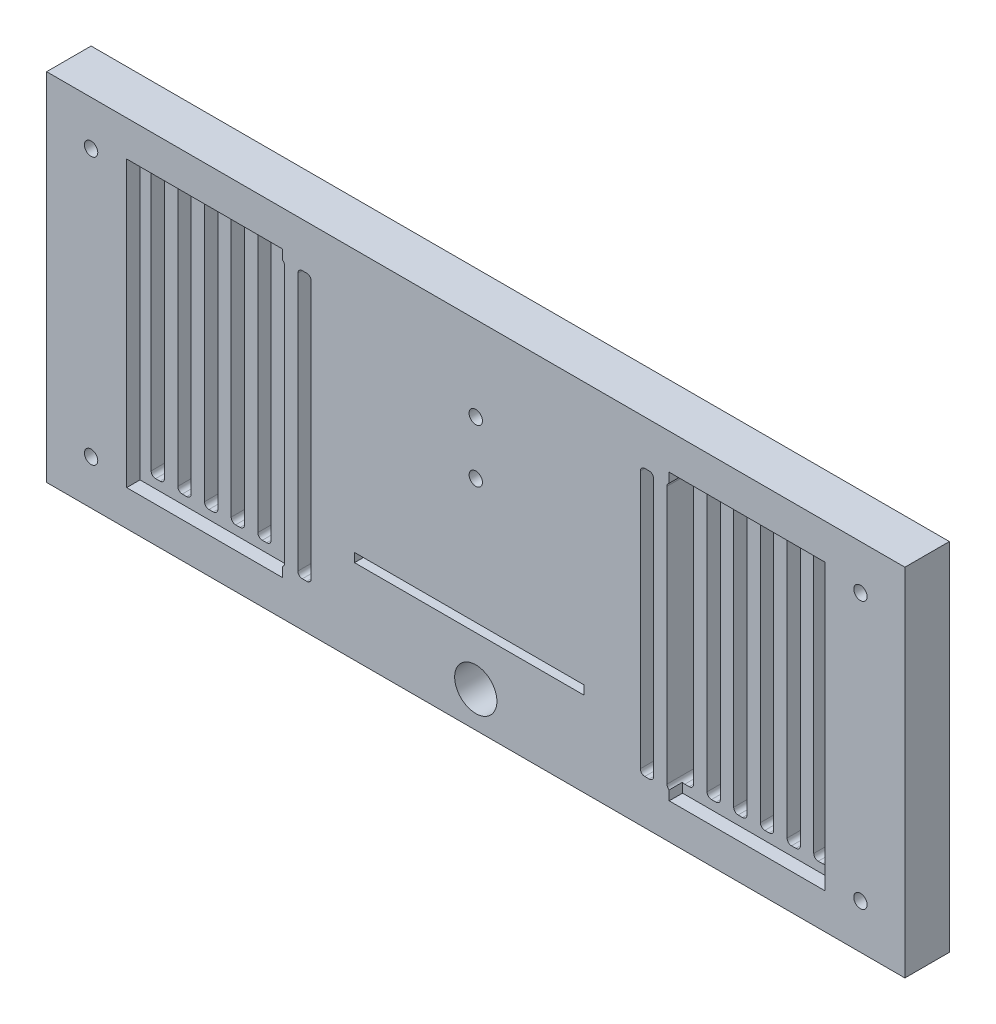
from build123d import *

# Parameters (mm, degrees)
ESQUISSE1_W                = 193
ESQUISSE1_H                = 80
BOSS_EXTRU_1_DEPTH         = 10
ENL_V_MAT_EXTRU_3_DEPTH    = 126.746769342
R_P_TITION_LIN_AIRE1_COUNT = 7
R_P_TITION_LIN_AIRE1_PITCH = 6
SYM_TRIE1_COPY_1_DEPTH     = 126.746769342
SYM_TRIE1_COPY_2_DEPTH     = 126.746769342
SYM_TRIE1_COPY_3_DEPTH     = 126.746769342
SYM_TRIE1_COPY_4_DEPTH     = 126.746769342
SYM_TRIE1_COPY_5_DEPTH     = 126.746769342
SYM_TRIE1_COPY_6_DEPTH     = 126.746769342
ESQUISSE4_R                = 1.5
ENL_V_MAT_EXTRU_4_DEPTH    = 126.746769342
ESQUISSE5_R                = 1.5
ESQUISSE5_R_2              = 4.75
ENL_V_MAT_EXTRU_5_DEPTH    = 126.746769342
ESQUISSE6_W                = 51.553327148
ESQUISSE6_H                = 2
ENL_V_MAT_EXTRU_6_DEPTH    = 126.746769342
ESQUISSE7_W                = 35
ESQUISSE7_H                = 64
ENL_V_MAT_EXTRU_7_DEPTH    = 3


with BuildPart() as part:
    # Esquisse1 → Boss.-Extru.1 (new body)
    with BuildSketch(Plane.XY):
        with Locations((0, 40)):
            Rectangle(ESQUISSE1_W, ESQUISSE1_H)
    extrude(amount=BOSS_EXTRU_1_DEPTH)

    # Esquisse3 → Enl_v. mat.-Extru.3 (cut, through all)
    with BuildSketch(Plane.XY.offset(10)):
        with BuildLine():
            Line((-39, 70), (-38, 70))
            ThreePointArc((-38, 70), (-37.292893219, 69.707106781), (-37, 69))
            Line((-37, 69), (-37, 11))
            ThreePointArc((-37, 11), (-37.292893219, 10.292893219), (-38, 10))
            Line((-38, 10), (-39, 10))
            ThreePointArc((-39, 10), (-39.707106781, 10.292893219), (-40, 11))
            Line((-40, 11), (-40, 69))
            ThreePointArc((-40, 69), (-39.707106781, 69.707106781), (-39, 70))
        make_face()
    enl_v_mat_extru_3 = extrude(amount=-ENL_V_MAT_EXTRU_3_DEPTH, mode=Mode.SUBTRACT)

    # R_p_tition lin_aire1: Enl_v. mat.-Extru.3 ×7
    with Locations(*[(-i * R_P_TITION_LIN_AIRE1_PITCH, 0, 0) for i in range(1, R_P_TITION_LIN_AIRE1_COUNT)]):
        add(enl_v_mat_extru_3, mode=Mode.SUBTRACT)

    # Sym_trie1: Enl_v. mat.-Extru.3 across plane
    add(enl_v_mat_extru_3.mirror(Plane(origin=(0, 0, 0), x_dir=(0, 0, 1), z_dir=(1, 0, 0))), mode=Mode.SUBTRACT)

    # Sym_trie1 copy 1 sketch → Sym_trie1 copy 1 (cut, through all)
    with BuildSketch(Plane(origin=(6, 0, 10), x_dir=(-1, 0, 0), z_dir=(0, 0, 1))):
        with BuildLine():
            Line((-39, -70), (-38, -70))
            ThreePointArc((-38, -70), (-37.292893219, -69.707106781), (-37, -69))
            Line((-37, -69), (-37, -11))
            ThreePointArc((-37, -11), (-37.292893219, -10.292893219), (-38, -10))
            Line((-38, -10), (-39, -10))
            ThreePointArc((-39, -10), (-39.707106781, -10.292893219), (-40, -11))
            Line((-40, -11), (-40, -69))
            ThreePointArc((-40, -69), (-39.707106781, -69.707106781), (-39, -70))
        make_face()
    extrude(amount=-SYM_TRIE1_COPY_1_DEPTH, mode=Mode.SUBTRACT)

    # Sym_trie1 copy 2 sketch → Sym_trie1 copy 2 (cut, through all)
    with BuildSketch(Plane(origin=(12, 0, 10), x_dir=(-1, 0, 0), z_dir=(0, 0, 1))):
        with BuildLine():
            Line((-39, -70), (-38, -70))
            ThreePointArc((-38, -70), (-37.292893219, -69.707106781), (-37, -69))
            Line((-37, -69), (-37, -11))
            ThreePointArc((-37, -11), (-37.292893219, -10.292893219), (-38, -10))
            Line((-38, -10), (-39, -10))
            ThreePointArc((-39, -10), (-39.707106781, -10.292893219), (-40, -11))
            Line((-40, -11), (-40, -69))
            ThreePointArc((-40, -69), (-39.707106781, -69.707106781), (-39, -70))
        make_face()
    extrude(amount=-SYM_TRIE1_COPY_2_DEPTH, mode=Mode.SUBTRACT)

    # Sym_trie1 copy 3 sketch → Sym_trie1 copy 3 (cut, through all)
    with BuildSketch(Plane(origin=(18, 0, 10), x_dir=(-1, 0, 0), z_dir=(0, 0, 1))):
        with BuildLine():
            Line((-39, -70), (-38, -70))
            ThreePointArc((-38, -70), (-37.292893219, -69.707106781), (-37, -69))
            Line((-37, -69), (-37, -11))
            ThreePointArc((-37, -11), (-37.292893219, -10.292893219), (-38, -10))
            Line((-38, -10), (-39, -10))
            ThreePointArc((-39, -10), (-39.707106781, -10.292893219), (-40, -11))
            Line((-40, -11), (-40, -69))
            ThreePointArc((-40, -69), (-39.707106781, -69.707106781), (-39, -70))
        make_face()
    extrude(amount=-SYM_TRIE1_COPY_3_DEPTH, mode=Mode.SUBTRACT)

    # Sym_trie1 copy 4 sketch → Sym_trie1 copy 4 (cut, through all)
    with BuildSketch(Plane(origin=(24, 0, 10), x_dir=(-1, 0, 0), z_dir=(0, 0, 1))):
        with BuildLine():
            Line((-39, -70), (-38, -70))
            ThreePointArc((-38, -70), (-37.292893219, -69.707106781), (-37, -69))
            Line((-37, -69), (-37, -11))
            ThreePointArc((-37, -11), (-37.292893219, -10.292893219), (-38, -10))
            Line((-38, -10), (-39, -10))
            ThreePointArc((-39, -10), (-39.707106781, -10.292893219), (-40, -11))
            Line((-40, -11), (-40, -69))
            ThreePointArc((-40, -69), (-39.707106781, -69.707106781), (-39, -70))
        make_face()
    extrude(amount=-SYM_TRIE1_COPY_4_DEPTH, mode=Mode.SUBTRACT)

    # Sym_trie1 copy 5 sketch → Sym_trie1 copy 5 (cut, through all)
    with BuildSketch(Plane(origin=(30, 0, 10), x_dir=(-1, 0, 0), z_dir=(0, 0, 1))):
        with BuildLine():
            Line((-39, -70), (-38, -70))
            ThreePointArc((-38, -70), (-37.292893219, -69.707106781), (-37, -69))
            Line((-37, -69), (-37, -11))
            ThreePointArc((-37, -11), (-37.292893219, -10.292893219), (-38, -10))
            Line((-38, -10), (-39, -10))
            ThreePointArc((-39, -10), (-39.707106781, -10.292893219), (-40, -11))
            Line((-40, -11), (-40, -69))
            ThreePointArc((-40, -69), (-39.707106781, -69.707106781), (-39, -70))
        make_face()
    extrude(amount=-SYM_TRIE1_COPY_5_DEPTH, mode=Mode.SUBTRACT)

    # Sym_trie1 copy 6 sketch → Sym_trie1 copy 6 (cut, through all)
    with BuildSketch(Plane(origin=(36, 0, 10), x_dir=(-1, 0, 0), z_dir=(0, 0, 1))):
        with BuildLine():
            Line((-39, -70), (-38, -70))
            ThreePointArc((-38, -70), (-37.292893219, -69.707106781), (-37, -69))
            Line((-37, -69), (-37, -11))
            ThreePointArc((-37, -11), (-37.292893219, -10.292893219), (-38, -10))
            Line((-38, -10), (-39, -10))
            ThreePointArc((-39, -10), (-39.707106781, -10.292893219), (-40, -11))
            Line((-40, -11), (-40, -69))
            ThreePointArc((-40, -69), (-39.707106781, -69.707106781), (-39, -70))
        make_face()
    extrude(amount=-SYM_TRIE1_COPY_6_DEPTH, mode=Mode.SUBTRACT)

    # Esquisse4 → Enl_v. mat.-Extru.4 (cut, through all)
    with BuildSketch(Plane.XY.offset(10)):
        with Locations((-86.5, 70)):
            Circle(ESQUISSE4_R)
        with Locations((-86.5, 10)):
            Circle(ESQUISSE4_R)
        with Locations((86.5, 70)):
            Circle(ESQUISSE4_R)
        with Locations((86.5, 10)):
            Circle(ESQUISSE4_R)
    extrude(amount=-ENL_V_MAT_EXTRU_4_DEPTH, mode=Mode.SUBTRACT)

    # Esquisse5 → Enl_v. mat.-Extru.5 (cut, through all)
    with BuildSketch(Plane.XY.offset(10)):
        with Locations((0, 49)):
            Circle(ESQUISSE5_R)
        with Locations((0, 61)):
            Circle(ESQUISSE5_R)
        with Locations((0, 8)):
            Circle(ESQUISSE5_R_2)
    extrude(amount=-ENL_V_MAT_EXTRU_5_DEPTH, mode=Mode.SUBTRACT)

    # Esquisse6 → Enl_v. mat.-Extru.6 (cut, through all)
    with BuildSketch(Plane.XY.offset(10)):
        with Locations((-1.491434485, 20)):
            Rectangle(ESQUISSE6_W, ESQUISSE6_H)
    extrude(amount=-ENL_V_MAT_EXTRU_6_DEPTH, mode=Mode.SUBTRACT)

    # Esquisse7 → Enl_v. mat.-Extru.7 (cut)
    with BuildSketch(Plane.XY.offset(10)):
        with Locations((-61, 40)):
            Rectangle(ESQUISSE7_W, ESQUISSE7_H)
        with Locations((61, 40)):
            Rectangle(ESQUISSE7_W, ESQUISSE7_H)
    extrude(amount=-ENL_V_MAT_EXTRU_7_DEPTH, mode=Mode.SUBTRACT)


solid = part.part
